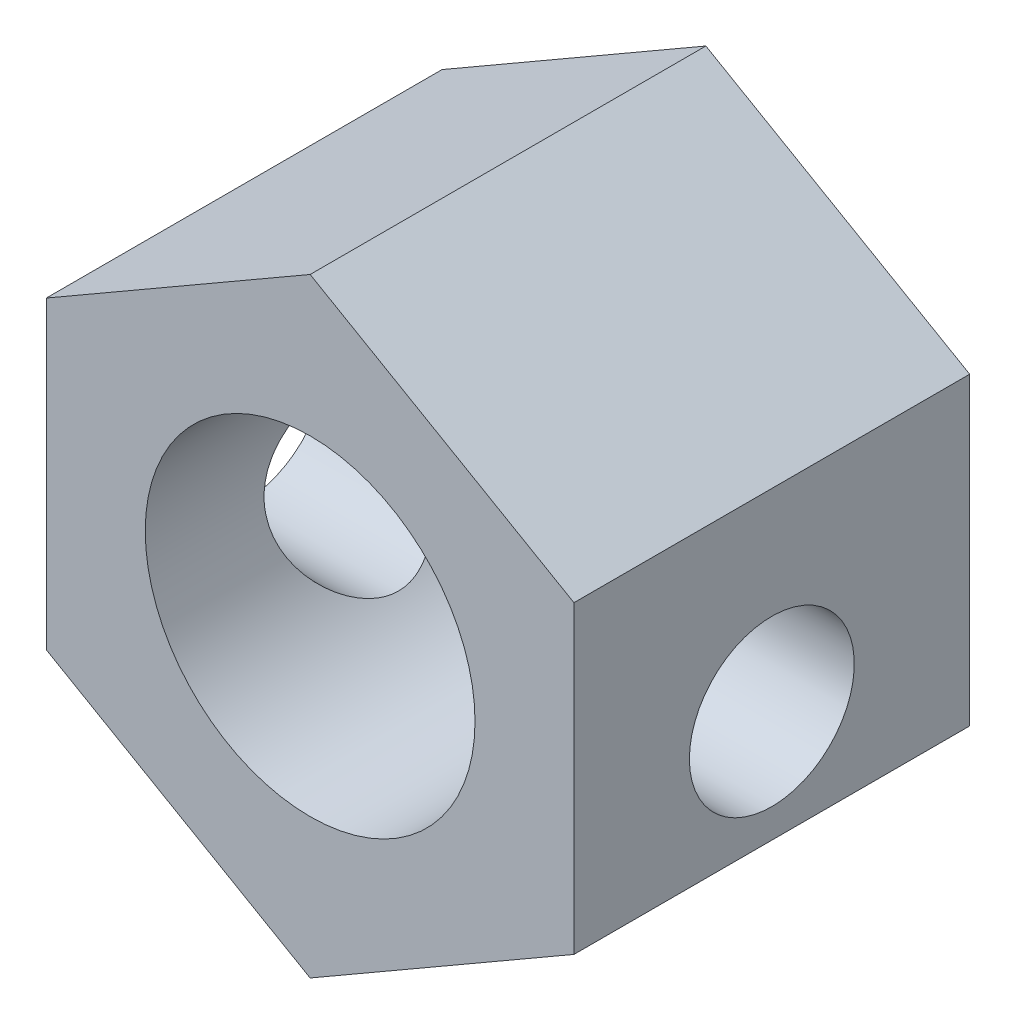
ISO-10303-21;
HEADER;
FILE_DESCRIPTION(('STEP AP214'),'2;1');
FILE_NAME('part.step','',(''),(''),'','','');
FILE_SCHEMA(('AUTOMOTIVE_DESIGN { 1 0 10303 214 1 1 1 1 }'));
ENDSEC;
DATA;
#1=APPLICATION_CONTEXT('core data for automotive mechanical design processes');
#2=APPLICATION_PROTOCOL_DEFINITION('international standard','automotive_design',2000,#1);
#3=PRODUCT_CONTEXT('',#1,'mechanical');
#4=PRODUCT('Part','Part','',(#3));
#5=PRODUCT_RELATED_PRODUCT_CATEGORY('part','',(#4));
#6=PRODUCT_DEFINITION_FORMATION('','',#4);
#7=PRODUCT_DEFINITION_CONTEXT('part definition',#1,'design');
#8=PRODUCT_DEFINITION('design','',#6,#7);
#9=PRODUCT_DEFINITION_SHAPE('','',#8);
#10=(LENGTH_UNIT() NAMED_UNIT(*) SI_UNIT(.MILLI.,.METRE.));
#11=(NAMED_UNIT(*) PLANE_ANGLE_UNIT() SI_UNIT($,.RADIAN.));
#12=(NAMED_UNIT(*) SI_UNIT($,.STERADIAN.) SOLID_ANGLE_UNIT());
#13=UNCERTAINTY_MEASURE_WITH_UNIT(LENGTH_MEASURE(1.E-05),#10,'distance_accuracy_value','');
#14=(GEOMETRIC_REPRESENTATION_CONTEXT(3) GLOBAL_UNCERTAINTY_ASSIGNED_CONTEXT((#13)) GLOBAL_UNIT_ASSIGNED_CONTEXT((#10,
#11,#12)) REPRESENTATION_CONTEXT('',''));
#15=CARTESIAN_POINT('',(0.,0.,0.));
#16=DIRECTION('',(0.,0.,1.));
#17=DIRECTION('',(1.,0.,0.));
#18=AXIS2_PLACEMENT_3D('',#15,#16,#17);
#19=CARTESIAN_POINT('',(0.,0.,6.));
#20=DIRECTION('',(0.,0.,1.));
#21=DIRECTION('',(1.,0.,0.));
#22=AXIS2_PLACEMENT_3D('',#19,#20,#21);
#23=PLANE('',#22);
#24=DIRECTION('',(0.866025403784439,-0.5,0.));
#25=VECTOR('',#24,1.);
#26=CARTESIAN_POINT('',(-7.74999999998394,-14.3094010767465,6.));
#27=LINE('',#26,#25);
#28=CARTESIAN_POINT('',(-7.74999999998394,-14.3094010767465,6.));
#29=VERTEX_POINT('',#28);
#30=CARTESIAN_POINT('',(-3.74999999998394,-16.6188021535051,6.));
#31=VERTEX_POINT('',#30);
#32=EDGE_CURVE('E119',#29,#31,#27,.T.);
#33=ORIENTED_EDGE('',*,*,#32,.T.);
#34=DIRECTION('',(0.866025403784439,0.5,0.));
#35=VECTOR('',#34,1.);
#36=CARTESIAN_POINT('',(-3.74999999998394,-16.6188021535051,6.));
#37=LINE('',#36,#35);
#38=CARTESIAN_POINT('',(0.250000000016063,-14.3094010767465,6.));
#39=VERTEX_POINT('',#38);
#40=EDGE_CURVE('E77',#31,#39,#37,.T.);
#41=ORIENTED_EDGE('',*,*,#40,.T.);
#42=DIRECTION('',(0.,1.,0.));
#43=VECTOR('',#42,1.);
#44=CARTESIAN_POINT('',(0.250000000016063,-14.3094010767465,6.));
#45=LINE('',#44,#43);
#46=CARTESIAN_POINT('',(0.250000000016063,-9.69059892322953,6.));
#47=VERTEX_POINT('',#46);
#48=EDGE_CURVE('E90',#39,#47,#45,.T.);
#49=ORIENTED_EDGE('',*,*,#48,.T.);
#50=DIRECTION('',(-0.866025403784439,0.5,0.));
#51=VECTOR('',#50,1.);
#52=CARTESIAN_POINT('',(0.250000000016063,-9.69059892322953,6.));
#53=LINE('',#52,#51);
#54=CARTESIAN_POINT('',(-3.74999999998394,-7.38119784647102,6.));
#55=VERTEX_POINT('',#54);
#56=EDGE_CURVE('E84',#47,#55,#53,.T.);
#57=ORIENTED_EDGE('',*,*,#56,.T.);
#58=DIRECTION('',(-0.866025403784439,-0.5,0.));
#59=VECTOR('',#58,1.);
#60=CARTESIAN_POINT('',(-3.74999999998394,-7.38119784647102,6.));
#61=LINE('',#60,#59);
#62=CARTESIAN_POINT('',(-7.74999999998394,-9.69059892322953,6.));
#63=VERTEX_POINT('',#62);
#64=EDGE_CURVE('E88',#55,#63,#61,.T.);
#65=ORIENTED_EDGE('',*,*,#64,.T.);
#66=DIRECTION('',(0.,-1.,0.));
#67=VECTOR('',#66,1.);
#68=CARTESIAN_POINT('',(-7.74999999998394,-9.69059892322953,6.));
#69=LINE('',#68,#67);
#70=EDGE_CURVE('E40',#63,#29,#69,.T.);
#71=ORIENTED_EDGE('',*,*,#70,.T.);
#72=EDGE_LOOP('',(#33,#41,#49,#57,#65,#71));
#73=FACE_BOUND('',#72,.T.);
#74=CARTESIAN_POINT('',(-3.74999999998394,-11.999999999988,6.));
#75=DIRECTION('',(0.,0.,1.));
#76=DIRECTION('',(1.,0.,0.));
#77=AXIS2_PLACEMENT_3D('',#74,#75,#76);
#78=CIRCLE('',#77,2.5);
#79=CARTESIAN_POINT('',(-1.24999999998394,-11.999999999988,6.));
#80=VERTEX_POINT('',#79);
#81=EDGE_CURVE('E112',#80,#80,#78,.T.);
#82=ORIENTED_EDGE('',*,*,#81,.F.);
#83=EDGE_LOOP('',(#82));
#84=FACE_BOUND('',#83,.T.);
#85=ADVANCED_FACE('F16',(#73,#84),#23,.T.);
#86=CARTESIAN_POINT('',(0.,0.,0.));
#87=DIRECTION('',(0.,0.,1.));
#88=DIRECTION('',(1.,0.,0.));
#89=AXIS2_PLACEMENT_3D('',#86,#87,#88);
#90=PLANE('',#89);
#91=DIRECTION('',(0.866025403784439,-0.5,0.));
#92=VECTOR('',#91,1.);
#93=CARTESIAN_POINT('',(-7.74999999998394,-14.3094010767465,0.));
#94=LINE('',#93,#92);
#95=CARTESIAN_POINT('',(-7.74999999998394,-14.3094010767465,0.));
#96=VERTEX_POINT('',#95);
#97=CARTESIAN_POINT('',(-3.74999999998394,-16.6188021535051,0.));
#98=VERTEX_POINT('',#97);
#99=EDGE_CURVE('E108',#96,#98,#94,.T.);
#100=ORIENTED_EDGE('',*,*,#99,.F.);
#101=DIRECTION('',(0.,-1.,0.));
#102=VECTOR('',#101,1.);
#103=CARTESIAN_POINT('',(-7.74999999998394,-9.69059892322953,0.));
#104=LINE('',#103,#102);
#105=CARTESIAN_POINT('',(-7.74999999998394,-9.69059892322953,0.));
#106=VERTEX_POINT('',#105);
#107=EDGE_CURVE('E69',#106,#96,#104,.T.);
#108=ORIENTED_EDGE('',*,*,#107,.F.);
#109=DIRECTION('',(-0.866025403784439,-0.5,0.));
#110=VECTOR('',#109,1.);
#111=CARTESIAN_POINT('',(-3.74999999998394,-7.38119784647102,0.));
#112=LINE('',#111,#110);
#113=CARTESIAN_POINT('',(-3.74999999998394,-7.38119784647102,0.));
#114=VERTEX_POINT('',#113);
#115=EDGE_CURVE('E63',#114,#106,#112,.T.);
#116=ORIENTED_EDGE('',*,*,#115,.F.);
#117=DIRECTION('',(-0.866025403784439,0.5,0.));
#118=VECTOR('',#117,1.);
#119=CARTESIAN_POINT('',(0.250000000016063,-9.69059892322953,0.));
#120=LINE('',#119,#118);
#121=CARTESIAN_POINT('',(0.250000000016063,-9.69059892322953,0.));
#122=VERTEX_POINT('',#121);
#123=EDGE_CURVE('E98',#122,#114,#120,.T.);
#124=ORIENTED_EDGE('',*,*,#123,.F.);
#125=DIRECTION('',(0.,1.,0.));
#126=VECTOR('',#125,1.);
#127=CARTESIAN_POINT('',(0.250000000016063,-14.3094010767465,0.));
#128=LINE('',#127,#126);
#129=CARTESIAN_POINT('',(0.250000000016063,-14.3094010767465,0.));
#130=VERTEX_POINT('',#129);
#131=EDGE_CURVE('E114',#130,#122,#128,.T.);
#132=ORIENTED_EDGE('',*,*,#131,.F.);
#133=DIRECTION('',(0.866025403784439,0.5,0.));
#134=VECTOR('',#133,1.);
#135=CARTESIAN_POINT('',(-3.74999999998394,-16.6188021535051,0.));
#136=LINE('',#135,#134);
#137=EDGE_CURVE('E111',#98,#130,#136,.T.);
#138=ORIENTED_EDGE('',*,*,#137,.F.);
#139=EDGE_LOOP('',(#100,#108,#116,#124,#132,#138));
#140=FACE_BOUND('',#139,.T.);
#141=CARTESIAN_POINT('',(-3.74999999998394,-11.999999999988,0.));
#142=DIRECTION('',(0.,0.,1.));
#143=DIRECTION('',(1.,0.,0.));
#144=AXIS2_PLACEMENT_3D('',#141,#142,#143);
#145=CIRCLE('',#144,2.5);
#146=CARTESIAN_POINT('',(-1.24999999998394,-11.999999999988,0.));
#147=VERTEX_POINT('',#146);
#148=EDGE_CURVE('E184',#147,#147,#145,.T.);
#149=ORIENTED_EDGE('',*,*,#148,.T.);
#150=EDGE_LOOP('',(#149));
#151=FACE_BOUND('',#150,.T.);
#152=ADVANCED_FACE('F150',(#140,#151),#90,.F.);
#153=CARTESIAN_POINT('',(-7.74999999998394,-14.3094010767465,6.));
#154=DIRECTION('',(0.5,0.866025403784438,0.));
#155=DIRECTION('',(-0.866025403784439,0.5,0.));
#156=AXIS2_PLACEMENT_3D('',#153,#154,#155);
#157=PLANE('',#156);
#158=ORIENTED_EDGE('',*,*,#99,.T.);
#159=DIRECTION('',(0.,0.,-1.));
#160=VECTOR('',#159,1.);
#161=CARTESIAN_POINT('',(-3.74999999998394,-16.6188021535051,6.));
#162=LINE('',#161,#160);
#163=EDGE_CURVE('E11',#31,#98,#162,.T.);
#164=ORIENTED_EDGE('',*,*,#163,.F.);
#165=ORIENTED_EDGE('',*,*,#32,.F.);
#166=DIRECTION('',(0.,0.,-1.));
#167=VECTOR('',#166,1.);
#168=CARTESIAN_POINT('',(-7.74999999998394,-14.3094010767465,6.));
#169=LINE('',#168,#167);
#170=EDGE_CURVE('E104',#29,#96,#169,.T.);
#171=ORIENTED_EDGE('',*,*,#170,.T.);
#172=EDGE_LOOP('',(#158,#164,#165,#171));
#173=FACE_BOUND('',#172,.T.);
#174=ADVANCED_FACE('F18',(#173),#157,.F.);
#175=CARTESIAN_POINT('',(-3.74999999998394,-16.6188021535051,6.));
#176=DIRECTION('',(-0.5,0.866025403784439,0.));
#177=DIRECTION('',(-0.866025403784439,-0.5,0.));
#178=AXIS2_PLACEMENT_3D('',#175,#176,#177);
#179=PLANE('',#178);
#180=ORIENTED_EDGE('',*,*,#137,.T.);
#181=DIRECTION('',(0.,0.,-1.));
#182=VECTOR('',#181,1.);
#183=CARTESIAN_POINT('',(0.250000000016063,-14.3094010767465,6.));
#184=LINE('',#183,#182);
#185=EDGE_CURVE('E31',#39,#130,#184,.T.);
#186=ORIENTED_EDGE('',*,*,#185,.F.);
#187=ORIENTED_EDGE('',*,*,#40,.F.);
#188=ORIENTED_EDGE('',*,*,#163,.T.);
#189=EDGE_LOOP('',(#180,#186,#187,#188));
#190=FACE_BOUND('',#189,.T.);
#191=ADVANCED_FACE('F167',(#190),#179,.F.);
#192=CARTESIAN_POINT('',(0.250000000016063,-14.3094010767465,6.));
#193=DIRECTION('',(-1.,0.,0.));
#194=DIRECTION('',(0.,-1.,0.));
#195=AXIS2_PLACEMENT_3D('',#192,#193,#194);
#196=PLANE('',#195);
#197=CARTESIAN_POINT('',(0.250000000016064,-12.618802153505,3.));
#198=DIRECTION('',(-1.,0.,0.));
#199=DIRECTION('',(0.,0.,1.));
#200=AXIS2_PLACEMENT_3D('',#197,#198,#199);
#201=CIRCLE('',#200,1.25);
#202=CARTESIAN_POINT('',(0.250000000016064,-12.618802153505,4.25));
#203=VERTEX_POINT('',#202);
#204=EDGE_CURVE('E129',#203,#203,#201,.T.);
#205=ORIENTED_EDGE('',*,*,#204,.T.);
#206=EDGE_LOOP('',(#205));
#207=FACE_BOUND('',#206,.T.);
#208=ORIENTED_EDGE('',*,*,#131,.T.);
#209=DIRECTION('',(0.,0.,-1.));
#210=VECTOR('',#209,1.);
#211=CARTESIAN_POINT('',(0.250000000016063,-9.69059892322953,6.));
#212=LINE('',#211,#210);
#213=EDGE_CURVE('E99',#47,#122,#212,.T.);
#214=ORIENTED_EDGE('',*,*,#213,.F.);
#215=ORIENTED_EDGE('',*,*,#48,.F.);
#216=ORIENTED_EDGE('',*,*,#185,.T.);
#217=EDGE_LOOP('',(#208,#214,#215,#216));
#218=FACE_BOUND('',#217,.T.);
#219=ADVANCED_FACE('F165',(#207,#218),#196,.F.);
#220=CARTESIAN_POINT('',(0.250000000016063,-9.69059892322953,6.));
#221=DIRECTION('',(-0.5,-0.866025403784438,0.));
#222=DIRECTION('',(0.866025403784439,-0.5,0.));
#223=AXIS2_PLACEMENT_3D('',#220,#221,#222);
#224=PLANE('',#223);
#225=ORIENTED_EDGE('',*,*,#123,.T.);
#226=DIRECTION('',(0.,0.,-1.));
#227=VECTOR('',#226,1.);
#228=CARTESIAN_POINT('',(-3.74999999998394,-7.38119784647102,6.));
#229=LINE('',#228,#227);
#230=EDGE_CURVE('E95',#55,#114,#229,.T.);
#231=ORIENTED_EDGE('',*,*,#230,.F.);
#232=ORIENTED_EDGE('',*,*,#56,.F.);
#233=ORIENTED_EDGE('',*,*,#213,.T.);
#234=EDGE_LOOP('',(#225,#231,#232,#233));
#235=FACE_BOUND('',#234,.T.);
#236=ADVANCED_FACE('F96',(#235),#224,.F.);
#237=CARTESIAN_POINT('',(-3.74999999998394,-7.38119784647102,6.));
#238=DIRECTION('',(0.5,-0.866025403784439,0.));
#239=DIRECTION('',(0.866025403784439,0.5,0.));
#240=AXIS2_PLACEMENT_3D('',#237,#238,#239);
#241=PLANE('',#240);
#242=ORIENTED_EDGE('',*,*,#115,.T.);
#243=DIRECTION('',(0.,0.,-1.));
#244=VECTOR('',#243,1.);
#245=CARTESIAN_POINT('',(-7.74999999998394,-9.69059892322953,6.));
#246=LINE('',#245,#244);
#247=EDGE_CURVE('E100',#63,#106,#246,.T.);
#248=ORIENTED_EDGE('',*,*,#247,.F.);
#249=ORIENTED_EDGE('',*,*,#64,.F.);
#250=ORIENTED_EDGE('',*,*,#230,.T.);
#251=EDGE_LOOP('',(#242,#248,#249,#250));
#252=FACE_BOUND('',#251,.T.);
#253=ADVANCED_FACE('F102',(#252),#241,.F.);
#254=CARTESIAN_POINT('',(-7.74999999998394,-9.69059892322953,6.));
#255=DIRECTION('',(1.,0.,0.));
#256=DIRECTION('',(0.,1.,0.));
#257=AXIS2_PLACEMENT_3D('',#254,#255,#256);
#258=PLANE('',#257);
#259=CARTESIAN_POINT('',(-7.74999999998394,-12.618802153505,3.));
#260=DIRECTION('',(-1.,0.,0.));
#261=DIRECTION('',(0.,0.,1.));
#262=AXIS2_PLACEMENT_3D('',#259,#260,#261);
#263=CIRCLE('',#262,1.25);
#264=CARTESIAN_POINT('',(-7.74999999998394,-12.618802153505,4.25));
#265=VERTEX_POINT('',#264);
#266=EDGE_CURVE('E191',#265,#265,#263,.T.);
#267=ORIENTED_EDGE('',*,*,#266,.F.);
#268=EDGE_LOOP('',(#267));
#269=FACE_BOUND('',#268,.T.);
#270=ORIENTED_EDGE('',*,*,#107,.T.);
#271=ORIENTED_EDGE('',*,*,#170,.F.);
#272=ORIENTED_EDGE('',*,*,#70,.F.);
#273=ORIENTED_EDGE('',*,*,#247,.T.);
#274=EDGE_LOOP('',(#270,#271,#272,#273));
#275=FACE_BOUND('',#274,.T.);
#276=ADVANCED_FACE('F146',(#269,#275),#258,.F.);
#277=CARTESIAN_POINT('',(-3.74999999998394,-11.999999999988,6.));
#278=DIRECTION('',(0.,0.,-1.));
#279=DIRECTION('',(-1.,0.,0.));
#280=AXIS2_PLACEMENT_3D('',#277,#278,#279);
#281=CYLINDRICAL_SURFACE('',#280,2.5);
#282=CARTESIAN_POINT('',(-6.24999999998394,-11.999999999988,4.08608650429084));
#283=CARTESIAN_POINT('',(-6.25000028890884,-12.0560177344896,4.11800444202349));
#284=CARTESIAN_POINT('',(-6.24810475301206,-12.114508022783,4.14556928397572));
#285=CARTESIAN_POINT('',(-6.23968345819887,-12.2347322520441,4.19126818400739));
#286=CARTESIAN_POINT('',(-6.23316028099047,-12.2964643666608,4.20940749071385));
#287=CARTESIAN_POINT('',(-6.2150581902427,-12.4212639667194,4.23594094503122));
#288=CARTESIAN_POINT('',(-6.20347901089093,-12.4843315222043,4.24433458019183));
#289=CARTESIAN_POINT('',(-6.17531978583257,-12.6098907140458,4.25155034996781));
#290=CARTESIAN_POINT('',(-6.15873832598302,-12.6723821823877,4.25036977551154));
#291=CARTESIAN_POINT('',(-6.1208665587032,-12.79573825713,4.23898009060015));
#292=CARTESIAN_POINT('',(-6.09953031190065,-12.8565800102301,4.22867976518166));
#293=CARTESIAN_POINT('',(-6.05303788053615,-12.97470620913,4.19980572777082));
#294=CARTESIAN_POINT('',(-6.02788083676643,-13.0319898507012,4.1812301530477));
#295=CARTESIAN_POINT('',(-5.9715273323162,-13.1486931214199,4.13407814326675));
#296=CARTESIAN_POINT('',(-5.93996846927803,-13.2075624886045,4.10457794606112));
#297=CARTESIAN_POINT('',(-5.87462782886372,-13.3191465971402,4.03743253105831));
#298=CARTESIAN_POINT('',(-5.84084347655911,-13.3718540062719,3.99977775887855));
#299=CARTESIAN_POINT('',(-5.766947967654,-13.478785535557,3.91025691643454));
#300=CARTESIAN_POINT('',(-5.72671342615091,-13.5318224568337,3.85707085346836));
#301=CARTESIAN_POINT('',(-5.6481614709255,-13.6281371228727,3.74122517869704));
#302=CARTESIAN_POINT('',(-5.60984307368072,-13.6714199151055,3.67857049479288));
#303=CARTESIAN_POINT('',(-5.54942978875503,-13.7359164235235,3.56351258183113));
#304=CARTESIAN_POINT('',(-5.52585874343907,-13.7598869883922,3.51343202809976));
#305=CARTESIAN_POINT('',(-5.48370817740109,-13.8014245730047,3.40873099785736));
#306=CARTESIAN_POINT('',(-5.46511835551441,-13.819004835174,3.35412020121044));
#307=CARTESIAN_POINT('',(-5.43801820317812,-13.844145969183,3.25155371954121));
#308=CARTESIAN_POINT('',(-5.4282790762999,-13.8529591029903,3.2042372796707));
#309=CARTESIAN_POINT('',(-5.41482206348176,-13.8650611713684,3.10807128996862));
#310=CARTESIAN_POINT('',(-5.41109771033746,-13.8683560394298,3.059223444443));
#311=CARTESIAN_POINT('',(-5.41018894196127,-13.8691638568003,2.96132049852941));
#312=CARTESIAN_POINT('',(-5.41301722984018,-13.8666655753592,2.91226517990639));
#313=CARTESIAN_POINT('',(-5.424828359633,-13.8560735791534,2.81551284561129));
#314=CARTESIAN_POINT('',(-5.43381761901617,-13.8479740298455,2.76781730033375));
#315=CARTESIAN_POINT('',(-5.45987009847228,-13.8239326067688,2.66268409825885));
#316=CARTESIAN_POINT('',(-5.47843170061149,-13.8064919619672,2.60596830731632));
#317=CARTESIAN_POINT('',(-5.52102622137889,-13.7647535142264,2.49730488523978));
#318=CARTESIAN_POINT('',(-5.54507191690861,-13.7404396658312,2.44536879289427));
#319=CARTESIAN_POINT('',(-5.60591364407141,-13.6757701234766,2.3282071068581));
#320=CARTESIAN_POINT('',(-5.64413697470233,-13.632806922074,2.26516681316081));
#321=CARTESIAN_POINT('',(-5.72263137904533,-13.5370672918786,2.14853781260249));
#322=CARTESIAN_POINT('',(-5.76290452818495,-13.4842807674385,2.09495894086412));
#323=CARTESIAN_POINT('',(-5.84326046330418,-13.36868442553,1.99700266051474));
#324=CARTESIAN_POINT('',(-5.88332958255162,-13.3057260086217,1.95278847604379));
#325=CARTESIAN_POINT('',(-5.96001993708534,-13.1712307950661,1.87603547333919));
#326=CARTESIAN_POINT('',(-5.99664648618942,-13.099707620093,1.84347843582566));
#327=CARTESIAN_POINT('',(-6.05778587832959,-12.9636355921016,1.79677976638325));
#328=CARTESIAN_POINT('',(-6.08327977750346,-12.9003245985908,1.7803202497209));
#329=CARTESIAN_POINT('',(-6.12940268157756,-12.7701915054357,1.75744755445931));
#330=CARTESIAN_POINT('',(-6.15003457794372,-12.7033715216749,1.75102839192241));
#331=CARTESIAN_POINT('',(-6.18570011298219,-12.5677185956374,1.74919586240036));
#332=CARTESIAN_POINT('',(-6.20070590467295,-12.4988774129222,1.75383642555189));
#333=CARTESIAN_POINT('',(-6.22464346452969,-12.3618975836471,1.77472681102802));
#334=CARTESIAN_POINT('',(-6.23357674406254,-12.2937587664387,1.79097374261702));
#335=CARTESIAN_POINT('',(-6.24520845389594,-12.1663802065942,1.83298295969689));
#336=CARTESIAN_POINT('',(-6.24837066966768,-12.1068754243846,1.85782330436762));
#337=CARTESIAN_POINT('',(-6.25064474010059,-11.9923462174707,1.91639932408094));
#338=CARTESIAN_POINT('',(-6.24975638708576,-11.9373220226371,1.95013545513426));
#339=CARTESIAN_POINT('',(-6.24494454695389,-11.8325407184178,2.02607220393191));
#340=CARTESIAN_POINT('',(-6.24098193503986,-11.7828609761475,2.06837670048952));
#341=CARTESIAN_POINT('',(-6.23123312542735,-11.6907576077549,2.16008318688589));
#342=CARTESIAN_POINT('',(-6.22544632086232,-11.6483364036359,2.20948753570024));
#343=CARTESIAN_POINT('',(-6.21295062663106,-11.5692044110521,2.31763739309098));
#344=CARTESIAN_POINT('',(-6.20620628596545,-11.5330417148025,2.37678073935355));
#345=CARTESIAN_POINT('',(-6.19358463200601,-11.4709417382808,2.50030435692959));
#346=CARTESIAN_POINT('',(-6.18770738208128,-11.44500520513,2.5646850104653));
#347=CARTESIAN_POINT('',(-6.17794810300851,-11.40373590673,2.69820299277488));
#348=CARTESIAN_POINT('',(-6.17410394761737,-11.3886027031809,2.76740514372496));
#349=CARTESIAN_POINT('',(-6.16939824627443,-11.370233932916,2.9074628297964));
#350=CARTESIAN_POINT('',(-6.16853596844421,-11.3669954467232,2.97831795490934));
#351=CARTESIAN_POINT('',(-6.1699531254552,-11.3724398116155,3.11736860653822));
#352=CARTESIAN_POINT('',(-6.17213788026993,-11.3807633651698,3.18557951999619));
#353=CARTESIAN_POINT('',(-6.17903799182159,-11.4084135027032,3.31959676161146));
#354=CARTESIAN_POINT('',(-6.18375356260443,-11.42774101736,3.38540288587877));
#355=CARTESIAN_POINT('',(-6.19479378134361,-11.4769162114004,3.51312815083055));
#356=CARTESIAN_POINT('',(-6.20112517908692,-11.506808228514,3.57502959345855));
#357=CARTESIAN_POINT('',(-6.21408833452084,-11.5763078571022,3.69311097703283));
#358=CARTESIAN_POINT('',(-6.22072023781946,-11.6159202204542,3.74928810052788));
#359=CARTESIAN_POINT('',(-6.23328715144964,-11.7074536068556,3.8587392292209));
#360=CARTESIAN_POINT('',(-6.23912274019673,-11.7601099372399,3.91141315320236));
#361=CARTESIAN_POINT('',(-6.24747797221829,-11.8740849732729,4.00667921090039));
#362=CARTESIAN_POINT('',(-6.24999966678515,-11.9353982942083,4.04927756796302));
#363=CARTESIAN_POINT('',(-6.24999999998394,-11.999999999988,4.08608650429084));
#364=B_SPLINE_CURVE_WITH_KNOTS('',3,(#282,#283,#284,#285,#286,#287,#288,#289,#290,#291,#292,
#293,#294,#295,#296,#297,#298,#299,#300,#301,#302,#303,#304,#305,#306,#307,#308,#309,#310,#311,
#312,#313,#314,#315,#316,#317,#318,#319,#320,#321,#322,#323,#324,#325,#326,#327,#328,#329,#330,
#331,#332,#333,#334,#335,#336,#337,#338,#339,#340,#341,#342,#343,#344,#345,#346,#347,#348,#349,
#350,#351,#352,#353,#354,#355,#356,#357,#358,#359,#360,#361,#362,#363),.UNSPECIFIED.,.T.,.F.,(4,
2,2,2,2,2,2,2,2,2,2,2,2,2,2,2,2,2,2,2,2,2,2,2,2,2,2,2,2,2,2,2,2,2,2,2,2,2,2,2,4),(0.,
0.193170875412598,0.386234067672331,0.579307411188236,0.772435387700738,0.967517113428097,
1.16264277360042,1.38087350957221,1.59936133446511,1.85393399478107,2.10837461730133,
2.28877119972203,2.46879179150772,2.61549016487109,2.76203069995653,2.90885555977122,
3.05583359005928,3.24132262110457,3.4272483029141,3.68190998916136,3.93683485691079,
4.1958918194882,4.45454210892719,4.66429296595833,4.8739187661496,5.08456884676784,
5.29516648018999,5.4879362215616,5.6807158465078,5.87598997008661,6.07132912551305,
6.27932501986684,6.48733610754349,6.69909663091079,6.91080517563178,7.11607991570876,
7.32137201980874,7.5275361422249,7.73380125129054,7.95671103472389,8.17948277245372),.UNSPECIFIED.);
#365=CARTESIAN_POINT('',(-6.24999999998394,-11.999999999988,4.08608650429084));
#366=VERTEX_POINT('',#365);
#367=EDGE_CURVE('E20',#366,#366,#364,.T.);
#368=ORIENTED_EDGE('',*,*,#367,.F.);
#369=EDGE_LOOP('',(#368));
#370=FACE_BOUND('',#369,.T.);
#371=CARTESIAN_POINT('',(-1.32779358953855,-12.618802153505,4.25));
#372=CARTESIAN_POINT('',(-1.31183547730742,-12.5563462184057,4.25000181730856));
#373=CARTESIAN_POINT('',(-1.29831707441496,-12.4932732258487,4.24530336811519));
#374=CARTESIAN_POINT('',(-1.27637145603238,-12.3677186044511,4.22616644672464));
#375=CARTESIAN_POINT('',(-1.26794278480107,-12.3052368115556,4.21173076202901));
#376=CARTESIAN_POINT('',(-1.25593483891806,-12.1828268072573,4.17326163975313));
#377=CARTESIAN_POINT('',(-1.25235527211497,-12.1228984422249,4.14922878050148));
#378=CARTESIAN_POINT('',(-1.24934227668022,-12.0073805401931,4.09216155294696));
#379=CARTESIAN_POINT('',(-1.24991001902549,-11.9517922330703,4.05912464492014));
#380=CARTESIAN_POINT('',(-1.25418022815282,-11.8460048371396,3.98463548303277));
#381=CARTESIAN_POINT('',(-1.25790986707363,-11.7958567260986,3.94311265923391));
#382=CARTESIAN_POINT('',(-1.26729919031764,-11.7026903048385,3.85290510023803));
#383=CARTESIAN_POINT('',(-1.27295944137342,-11.6596740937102,3.80421826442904));
#384=CARTESIAN_POINT('',(-1.28531221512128,-11.5791899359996,3.69746570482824));
#385=CARTESIAN_POINT('',(-1.29204787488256,-11.5422626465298,3.63899652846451));
#386=CARTESIAN_POINT('',(-1.30477858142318,-11.4785084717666,3.51670698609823));
#387=CARTESIAN_POINT('',(-1.3107735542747,-11.4516825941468,3.45288608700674));
#388=CARTESIAN_POINT('',(-1.32089273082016,-11.4084370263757,3.32013952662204));
#389=CARTESIAN_POINT('',(-1.32497450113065,-11.3922504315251,3.25113423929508));
#390=CARTESIAN_POINT('',(-1.33019989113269,-11.3717621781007,3.11128004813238));
#391=CARTESIAN_POINT('',(-1.33134426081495,-11.3674574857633,3.04043161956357));
#392=CARTESIAN_POINT('',(-1.33046637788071,-11.37082786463,2.90118021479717));
#393=CARTESIAN_POINT('',(-1.32853822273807,-11.3781469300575,2.83276771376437));
#394=CARTESIAN_POINT('',(-1.32208285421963,-11.4038530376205,2.69818289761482));
#395=CARTESIAN_POINT('',(-1.31755535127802,-11.4222413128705,2.63201083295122));
#396=CARTESIAN_POINT('',(-1.30680082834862,-11.4695631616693,2.50356845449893));
#397=CARTESIAN_POINT('',(-1.3005706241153,-11.4985165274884,2.44130572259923));
#398=CARTESIAN_POINT('',(-1.28768620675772,-11.5661872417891,2.32236776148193));
#399=CARTESIAN_POINT('',(-1.28103188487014,-11.6049071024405,2.26569397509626));
#400=CARTESIAN_POINT('',(-1.26858306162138,-11.6924626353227,2.1577610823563));
#401=CARTESIAN_POINT('',(-1.26282039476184,-11.7415672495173,2.10671577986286));
#402=CARTESIAN_POINT('',(-1.25406721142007,-11.8478345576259,2.01354260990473));
#403=CARTESIAN_POINT('',(-1.25107601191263,-11.9049952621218,1.97141254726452));
#404=CARTESIAN_POINT('',(-1.24942675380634,-12.0240805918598,1.89838630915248));
#405=CARTESIAN_POINT('',(-1.25065557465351,-12.0858380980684,1.86722117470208));
#406=CARTESIAN_POINT('',(-1.25830428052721,-12.2133579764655,1.81558440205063));
#407=CARTESIAN_POINT('',(-1.26472134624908,-12.2791181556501,1.79510696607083));
#408=CARTESIAN_POINT('',(-1.28272436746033,-12.408067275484,1.76623411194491));
#409=CARTESIAN_POINT('',(-1.29395570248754,-12.4711538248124,1.75715323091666));
#410=CARTESIAN_POINT('',(-1.32144335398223,-12.5968694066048,1.74860494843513));
#411=CARTESIAN_POINT('',(-1.33770006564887,-12.6594984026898,1.74913830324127));
#412=CARTESIAN_POINT('',(-1.3749150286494,-12.7830500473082,1.75927622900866));
#413=CARTESIAN_POINT('',(-1.3959063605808,-12.8439571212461,1.76894623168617));
#414=CARTESIAN_POINT('',(-1.44175409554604,-12.9623069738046,1.79658749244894));
#415=CARTESIAN_POINT('',(-1.46661149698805,-13.019748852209,1.81456089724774));
#416=CARTESIAN_POINT('',(-1.52230740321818,-13.136682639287,1.86040065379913));
#417=CARTESIAN_POINT('',(-1.55350505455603,-13.1956480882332,1.88916830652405));
#418=CARTESIAN_POINT('',(-1.61819909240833,-13.3075209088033,1.95482936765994));
#419=CARTESIAN_POINT('',(-1.65169799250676,-13.3604214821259,1.99173176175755));
#420=CARTESIAN_POINT('',(-1.72510683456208,-13.4678922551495,2.07960085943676));
#421=CARTESIAN_POINT('',(-1.76516043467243,-13.5212904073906,2.13188437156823));
#422=CARTESIAN_POINT('',(-1.84359394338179,-13.6184878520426,2.24585354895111));
#423=CARTESIAN_POINT('',(-1.88197444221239,-13.6622905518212,2.30753586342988));
#424=CARTESIAN_POINT('',(-1.94336039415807,-13.7284378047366,2.42183131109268));
#425=CARTESIAN_POINT('',(-1.96768337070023,-13.7533670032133,2.4722388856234));
#426=CARTESIAN_POINT('',(-2.01138334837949,-13.7967074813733,2.57777073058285));
#427=CARTESIAN_POINT('',(-2.03077049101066,-13.8151321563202,2.63288501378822));
#428=CARTESIAN_POINT('',(-2.05913524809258,-13.8415428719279,2.73606174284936));
#429=CARTESIAN_POINT('',(-2.06940205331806,-13.8508598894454,2.7834209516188));
#430=CARTESIAN_POINT('',(-2.08393578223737,-13.8639553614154,2.87979134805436));
#431=CARTESIAN_POINT('',(-2.08820959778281,-13.8677401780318,2.92880057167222));
#432=CARTESIAN_POINT('',(-2.09016267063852,-13.8694765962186,3.02718212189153));
#433=CARTESIAN_POINT('',(-2.08782562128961,-13.8674137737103,3.07655504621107));
#434=CARTESIAN_POINT('',(-2.07686796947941,-13.8576004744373,3.17402786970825));
#435=CARTESIAN_POINT('',(-2.06824102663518,-13.8498442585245,3.22212643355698));
#436=CARTESIAN_POINT('',(-2.04306823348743,-13.826674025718,3.32726802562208));
#437=CARTESIAN_POINT('',(-2.02511076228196,-13.809860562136,3.38365695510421));
#438=CARTESIAN_POINT('',(-1.98367949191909,-13.7694486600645,3.49179616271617));
#439=CARTESIAN_POINT('',(-1.96019294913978,-13.7458345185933,3.5435353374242));
#440=CARTESIAN_POINT('',(-1.90046552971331,-13.6827765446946,3.66059564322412));
#441=CARTESIAN_POINT('',(-1.86274240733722,-13.6407164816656,3.72374543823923));
#442=CARTESIAN_POINT('',(-1.78507299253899,-13.5468647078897,3.84073216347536));
#443=CARTESIAN_POINT('',(-1.74512449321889,-13.4950632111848,3.89455962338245));
#444=CARTESIAN_POINT('',(-1.66518111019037,-13.3814626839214,3.99327976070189));
#445=CARTESIAN_POINT('',(-1.62519767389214,-13.3195044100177,4.03799939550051));
#446=CARTESIAN_POINT('',(-1.54844766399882,-13.187018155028,4.11603089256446));
#447=CARTESIAN_POINT('',(-1.51167772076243,-13.1164993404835,4.14935481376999));
#448=CARTESIAN_POINT('',(-1.44740074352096,-12.9763726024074,4.19981407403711));
#449=CARTESIAN_POINT('',(-1.41931852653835,-12.9075330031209,4.21833610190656));
#450=CARTESIAN_POINT('',(-1.36895600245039,-12.7656804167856,4.24342033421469));
#451=CARTESIAN_POINT('',(-1.34666829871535,-12.6926728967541,4.24999785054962));
#452=CARTESIAN_POINT('',(-1.32779358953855,-12.618802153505,4.25));
#453=B_SPLINE_CURVE_WITH_KNOTS('',3,(#371,#372,#373,#374,#375,#376,#377,#378,#379,#380,#381,
#382,#383,#384,#385,#386,#387,#388,#389,#390,#391,#392,#393,#394,#395,#396,#397,#398,#399,#400,
#401,#402,#403,#404,#405,#406,#407,#408,#409,#410,#411,#412,#413,#414,#415,#416,#417,#418,#419,
#420,#421,#422,#423,#424,#425,#426,#427,#428,#429,#430,#431,#432,#433,#434,#435,#436,#437,#438,
#439,#440,#441,#442,#443,#444,#445,#446,#447,#448,#449,#450,#451,#452),.UNSPECIFIED.,.T.,.F.,(4,
2,2,2,2,2,2,2,2,2,2,2,2,2,2,2,2,2,2,2,2,2,2,2,2,2,2,2,2,2,2,2,2,2,2,2,2,2,2,2,4),(0.,
0.193138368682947,0.386221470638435,0.579292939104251,0.772418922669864,0.967221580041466,
1.16208147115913,1.36957708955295,1.57709340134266,1.78901674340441,2.00088597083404,
2.20639031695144,2.41191756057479,2.61783182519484,2.8237991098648,3.03595375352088,
3.24805609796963,3.4545177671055,3.66086731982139,3.85409571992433,4.04733931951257,
4.2419773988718,4.43666582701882,4.65378775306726,4.87115072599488,5.12447918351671,
5.3777175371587,5.56096142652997,5.74382571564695,5.89125248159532,6.0385095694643,
6.18613020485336,6.33389985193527,6.51744845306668,6.70142431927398,6.95430898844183,
7.20744906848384,7.46502376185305,7.72232504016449,7.95105591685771,8.17949337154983),.UNSPECIFIED.);
#454=CARTESIAN_POINT('',(-1.32779358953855,-12.618802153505,4.25));
#455=VERTEX_POINT('',#454);
#456=EDGE_CURVE('E124',#455,#455,#453,.T.);
#457=ORIENTED_EDGE('',*,*,#456,.F.);
#458=EDGE_LOOP('',(#457));
#459=FACE_BOUND('',#458,.T.);
#460=ORIENTED_EDGE('',*,*,#81,.T.);
#461=EDGE_LOOP('',(#460));
#462=FACE_BOUND('',#461,.T.);
#463=ORIENTED_EDGE('',*,*,#148,.F.);
#464=EDGE_LOOP('',(#463));
#465=FACE_BOUND('',#464,.T.);
#466=ADVANCED_FACE('F130',(#370,#459,#462,#465),#281,.F.);
#467=CARTESIAN_POINT('',(-7.74999999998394,-12.618802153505,3.));
#468=DIRECTION('',(-1.,0.,0.));
#469=DIRECTION('',(0.,0.,1.));
#470=AXIS2_PLACEMENT_3D('',#467,#468,#469);
#471=CYLINDRICAL_SURFACE('',#470,1.25);
#472=ORIENTED_EDGE('',*,*,#456,.T.);
#473=EDGE_LOOP('',(#472));
#474=FACE_BOUND('',#473,.T.);
#475=ORIENTED_EDGE('',*,*,#204,.F.);
#476=EDGE_LOOP('',(#475));
#477=FACE_BOUND('',#476,.T.);
#478=ADVANCED_FACE('F133',(#474,#477),#471,.F.);
#479=ORIENTED_EDGE('',*,*,#367,.T.);
#480=EDGE_LOOP('',(#479));
#481=FACE_BOUND('',#480,.T.);
#482=ORIENTED_EDGE('',*,*,#266,.T.);
#483=EDGE_LOOP('',(#482));
#484=FACE_BOUND('',#483,.T.);
#485=ADVANCED_FACE('F136',(#481,#484),#471,.F.);
#486=CLOSED_SHELL('',(#85,#152,#174,#191,#219,#236,#253,#276,#466,#478,#485));
#487=MANIFOLD_SOLID_BREP('B1',#486);
#488=ADVANCED_BREP_SHAPE_REPRESENTATION('',(#18,#487),#14);
#489=SHAPE_DEFINITION_REPRESENTATION(#9,#488);
ENDSEC;
END-ISO-10303-21;
